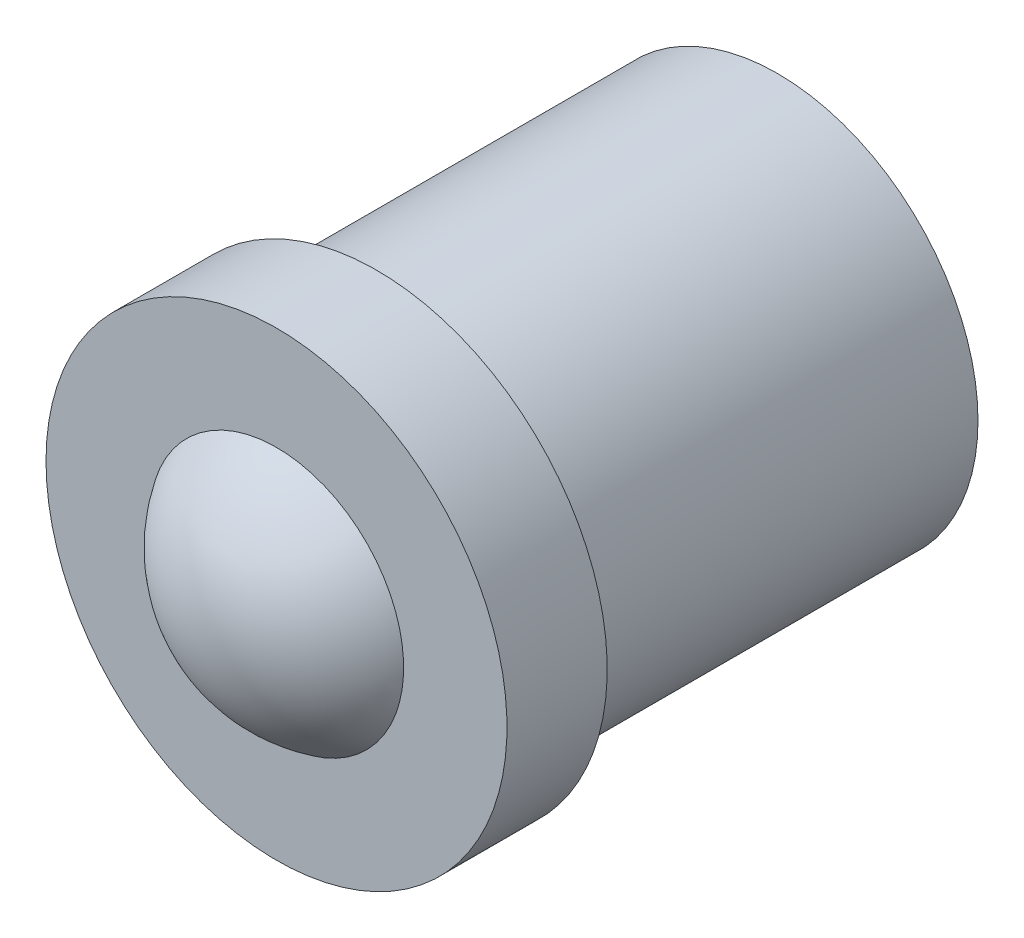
ISO-10303-21;
HEADER;
FILE_DESCRIPTION(('STEP AP214'),'2;1');
FILE_NAME('part.step','',(''),(''),'','','');
FILE_SCHEMA(('AUTOMOTIVE_DESIGN { 1 0 10303 214 1 1 1 1 }'));
ENDSEC;
DATA;
#1=APPLICATION_CONTEXT('core data for automotive mechanical design processes');
#2=APPLICATION_PROTOCOL_DEFINITION('international standard','automotive_design',2000,#1);
#3=PRODUCT_CONTEXT('',#1,'mechanical');
#4=PRODUCT('Part','Part','',(#3));
#5=PRODUCT_RELATED_PRODUCT_CATEGORY('part','',(#4));
#6=PRODUCT_DEFINITION_FORMATION('','',#4);
#7=PRODUCT_DEFINITION_CONTEXT('part definition',#1,'design');
#8=PRODUCT_DEFINITION('design','',#6,#7);
#9=PRODUCT_DEFINITION_SHAPE('','',#8);
#10=(LENGTH_UNIT() NAMED_UNIT(*) SI_UNIT(.MILLI.,.METRE.));
#11=(NAMED_UNIT(*) PLANE_ANGLE_UNIT() SI_UNIT($,.RADIAN.));
#12=(NAMED_UNIT(*) SI_UNIT($,.STERADIAN.) SOLID_ANGLE_UNIT());
#13=UNCERTAINTY_MEASURE_WITH_UNIT(LENGTH_MEASURE(1.E-05),#10,'distance_accuracy_value','');
#14=(GEOMETRIC_REPRESENTATION_CONTEXT(3) GLOBAL_UNCERTAINTY_ASSIGNED_CONTEXT((#13)) GLOBAL_UNIT_ASSIGNED_CONTEXT((#10,
#11,#12)) REPRESENTATION_CONTEXT('',''));
#15=CARTESIAN_POINT('',(0.,0.,0.));
#16=DIRECTION('',(0.,0.,1.));
#17=DIRECTION('',(1.,0.,0.));
#18=AXIS2_PLACEMENT_3D('',#15,#16,#17);
#19=CARTESIAN_POINT('',(0.,0.,0.2));
#20=DIRECTION('',(-1.,0.,0.));
#21=DIRECTION('',(0.,0.,-1.));
#22=AXIS2_PLACEMENT_3D('',#19,#20,#21);
#23=SPHERICAL_SURFACE('',#22,1.5);
#24=CARTESIAN_POINT('',(0.,0.,0.2));
#25=DIRECTION('',(0.,0.,1.));
#26=DIRECTION('',(-1.,0.,0.));
#27=AXIS2_PLACEMENT_3D('',#24,#25,#26);
#28=SPHERICAL_SURFACE('',#27,1.5);
#29=CARTESIAN_POINT('',(0.,0.,1.));
#30=DIRECTION('',(0.,0.,1.));
#31=DIRECTION('',(-1.,0.,0.));
#32=AXIS2_PLACEMENT_3D('',#29,#30,#31);
#33=CIRCLE('',#32,1.26885775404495);
#34=CARTESIAN_POINT('',(-1.26885775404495,0.,1.));
#35=VERTEX_POINT('',#34);
#36=EDGE_CURVE('E31',#35,#35,#33,.T.);
#37=ORIENTED_EDGE('',*,*,#36,.T.);
#38=EDGE_LOOP('',(#37));
#39=FACE_BOUND('',#38,.T.);
#40=ADVANCED_FACE('F12',(#39),#28,.T.);
#41=CARTESIAN_POINT('',(0.,0.,-4.));
#42=DIRECTION('',(0.,0.,1.));
#43=DIRECTION('',(-1.,0.,0.));
#44=AXIS2_PLACEMENT_3D('',#41,#42,#43);
#45=PLANE('',#44);
#46=CARTESIAN_POINT('',(0.,0.,-4.));
#47=DIRECTION('',(0.,0.,1.));
#48=DIRECTION('',(-1.,0.,0.));
#49=AXIS2_PLACEMENT_3D('',#46,#47,#48);
#50=CIRCLE('',#49,2.);
#51=CARTESIAN_POINT('',(-2.,0.,-4.));
#52=VERTEX_POINT('',#51);
#53=EDGE_CURVE('E8',#52,#52,#50,.T.);
#54=ORIENTED_EDGE('',*,*,#53,.F.);
#55=EDGE_LOOP('',(#54));
#56=FACE_BOUND('',#55,.T.);
#57=ADVANCED_FACE('F57',(#56),#45,.F.);
#58=CARTESIAN_POINT('',(0.,0.,3.));
#59=DIRECTION('',(0.,0.,1.));
#60=DIRECTION('',(-1.,0.,0.));
#61=AXIS2_PLACEMENT_3D('',#58,#59,#60);
#62=CYLINDRICAL_SURFACE('',#61,2.);
#63=CARTESIAN_POINT('',(0.,0.,0.));
#64=DIRECTION('',(0.,0.,1.));
#65=DIRECTION('',(-1.,0.,0.));
#66=AXIS2_PLACEMENT_3D('',#63,#64,#65);
#67=CIRCLE('',#66,2.);
#68=CARTESIAN_POINT('',(-2.,0.,0.));
#69=VERTEX_POINT('',#68);
#70=EDGE_CURVE('E18',#69,#69,#67,.T.);
#71=ORIENTED_EDGE('',*,*,#70,.F.);
#72=EDGE_LOOP('',(#71));
#73=FACE_BOUND('',#72,.T.);
#74=ORIENTED_EDGE('',*,*,#53,.T.);
#75=EDGE_LOOP('',(#74));
#76=FACE_BOUND('',#75,.T.);
#77=ADVANCED_FACE('F50',(#73,#76),#62,.T.);
#78=CARTESIAN_POINT('',(0.,-2.,0.));
#79=DIRECTION('',(0.,0.,1.));
#80=DIRECTION('',(-1.,0.,0.));
#81=AXIS2_PLACEMENT_3D('',#78,#79,#80);
#82=PLANE('',#81);
#83=CARTESIAN_POINT('',(0.,0.,0.));
#84=DIRECTION('',(0.,0.,1.));
#85=DIRECTION('',(-1.,0.,0.));
#86=AXIS2_PLACEMENT_3D('',#83,#84,#85);
#87=CIRCLE('',#86,2.3);
#88=CARTESIAN_POINT('',(-2.3,0.,0.));
#89=VERTEX_POINT('',#88);
#90=EDGE_CURVE('E22',#89,#89,#87,.T.);
#91=ORIENTED_EDGE('',*,*,#90,.F.);
#92=EDGE_LOOP('',(#91));
#93=FACE_BOUND('',#92,.T.);
#94=ORIENTED_EDGE('',*,*,#70,.T.);
#95=EDGE_LOOP('',(#94));
#96=FACE_BOUND('',#95,.T.);
#97=ADVANCED_FACE('F45',(#93,#96),#82,.F.);
#98=CARTESIAN_POINT('',(0.,0.,3.));
#99=DIRECTION('',(0.,0.,1.));
#100=DIRECTION('',(-1.,0.,0.));
#101=AXIS2_PLACEMENT_3D('',#98,#99,#100);
#102=CYLINDRICAL_SURFACE('',#101,2.3);
#103=CARTESIAN_POINT('',(0.,0.,1.));
#104=DIRECTION('',(0.,0.,1.));
#105=DIRECTION('',(-1.,0.,0.));
#106=AXIS2_PLACEMENT_3D('',#103,#104,#105);
#107=CIRCLE('',#106,2.3);
#108=CARTESIAN_POINT('',(-2.3,0.,1.));
#109=VERTEX_POINT('',#108);
#110=EDGE_CURVE('E26',#109,#109,#107,.T.);
#111=ORIENTED_EDGE('',*,*,#110,.F.);
#112=EDGE_LOOP('',(#111));
#113=FACE_BOUND('',#112,.T.);
#114=ORIENTED_EDGE('',*,*,#90,.T.);
#115=EDGE_LOOP('',(#114));
#116=FACE_BOUND('',#115,.T.);
#117=ADVANCED_FACE('F39',(#113,#116),#102,.T.);
#118=CARTESIAN_POINT('',(0.,-2.3,1.));
#119=DIRECTION('',(0.,0.,-1.));
#120=DIRECTION('',(1.,0.,0.));
#121=AXIS2_PLACEMENT_3D('',#118,#119,#120);
#122=PLANE('',#121);
#123=ORIENTED_EDGE('',*,*,#36,.F.);
#124=EDGE_LOOP('',(#123));
#125=FACE_BOUND('',#124,.T.);
#126=ORIENTED_EDGE('',*,*,#110,.T.);
#127=EDGE_LOOP('',(#126));
#128=FACE_BOUND('',#127,.T.);
#129=ADVANCED_FACE('F36',(#125,#128),#122,.F.);
#130=CLOSED_SHELL('',(#40,#57,#77,#97,#117,#129));
#131=MANIFOLD_SOLID_BREP('B1',#130);
#132=ADVANCED_BREP_SHAPE_REPRESENTATION('',(#18,#131),#14);
#133=SHAPE_DEFINITION_REPRESENTATION(#9,#132);
ENDSEC;
END-ISO-10303-21;
